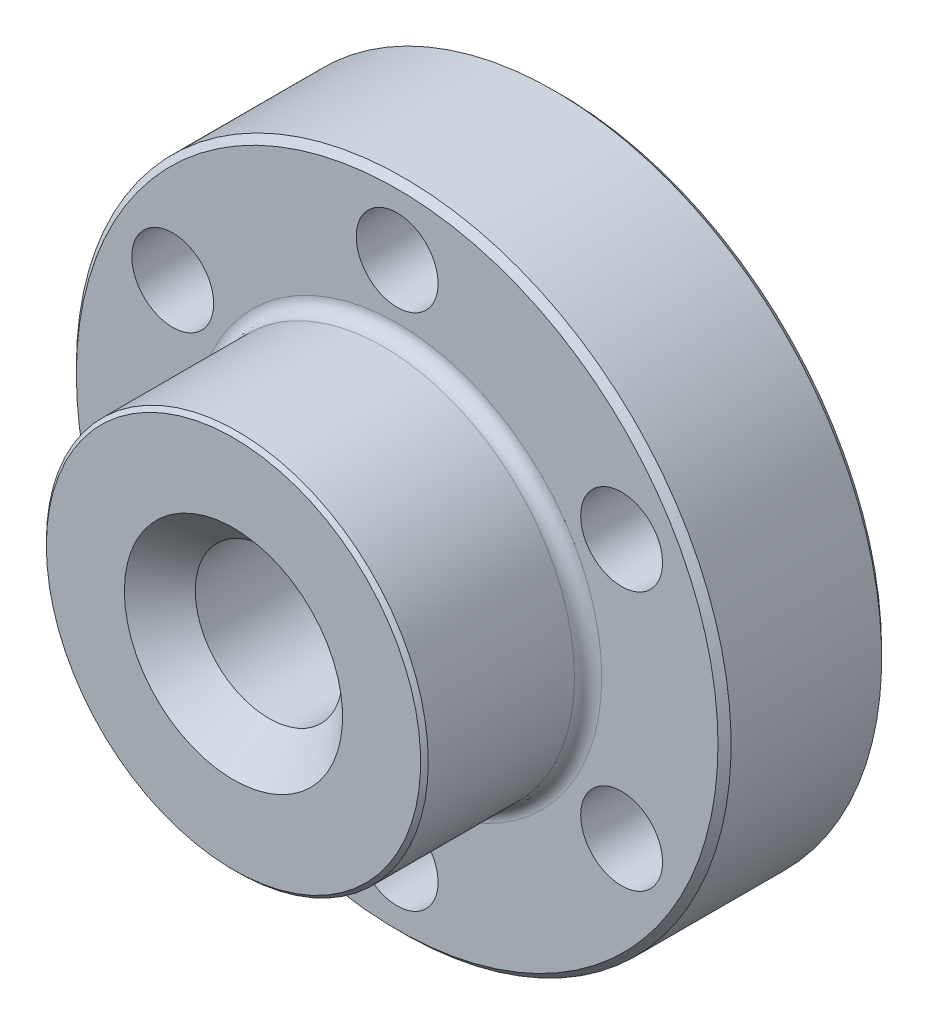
ISO-10303-21;
HEADER;
FILE_DESCRIPTION(('STEP AP214'),'2;1');
FILE_NAME('part.step','',(''),(''),'','','');
FILE_SCHEMA(('AUTOMOTIVE_DESIGN { 1 0 10303 214 1 1 1 1 }'));
ENDSEC;
DATA;
#1=APPLICATION_CONTEXT('core data for automotive mechanical design processes');
#2=APPLICATION_PROTOCOL_DEFINITION('international standard','automotive_design',2000,#1);
#3=PRODUCT_CONTEXT('',#1,'mechanical');
#4=PRODUCT('Part','Part','',(#3));
#5=PRODUCT_RELATED_PRODUCT_CATEGORY('part','',(#4));
#6=PRODUCT_DEFINITION_FORMATION('','',#4);
#7=PRODUCT_DEFINITION_CONTEXT('part definition',#1,'design');
#8=PRODUCT_DEFINITION('design','',#6,#7);
#9=PRODUCT_DEFINITION_SHAPE('','',#8);
#10=(LENGTH_UNIT() NAMED_UNIT(*) SI_UNIT(.MILLI.,.METRE.));
#11=(NAMED_UNIT(*) PLANE_ANGLE_UNIT() SI_UNIT($,.RADIAN.));
#12=(NAMED_UNIT(*) SI_UNIT($,.STERADIAN.) SOLID_ANGLE_UNIT());
#13=UNCERTAINTY_MEASURE_WITH_UNIT(LENGTH_MEASURE(1.E-05),#10,'distance_accuracy_value','');
#14=(GEOMETRIC_REPRESENTATION_CONTEXT(3) GLOBAL_UNCERTAINTY_ASSIGNED_CONTEXT((#13)) GLOBAL_UNIT_ASSIGNED_CONTEXT((#10,
#11,#12)) REPRESENTATION_CONTEXT('',''));
#15=CARTESIAN_POINT('',(0.,0.,0.));
#16=DIRECTION('',(0.,0.,1.));
#17=DIRECTION('',(1.,0.,0.));
#18=AXIS2_PLACEMENT_3D('',#15,#16,#17);
#19=CARTESIAN_POINT('',(0.,23.52,0.));
#20=DIRECTION('',(0.,0.,1.));
#21=DIRECTION('',(1.,0.,0.));
#22=AXIS2_PLACEMENT_3D('',#19,#20,#21);
#23=PLANE('',#22);
#24=CARTESIAN_POINT('',(16.4544826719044,9.5,0.));
#25=DIRECTION('',(0.,0.,1.));
#26=DIRECTION('',(1.,0.,0.));
#27=AXIS2_PLACEMENT_3D('',#24,#25,#26);
#28=CIRCLE('',#27,3.);
#29=CARTESIAN_POINT('',(19.4544826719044,9.5,0.));
#30=VERTEX_POINT('',#29);
#31=EDGE_CURVE('E58',#30,#30,#28,.T.);
#32=ORIENTED_EDGE('',*,*,#31,.T.);
#33=EDGE_LOOP('',(#32));
#34=FACE_BOUND('',#33,.T.);
#35=CARTESIAN_POINT('',(16.4544826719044,-9.5,0.));
#36=DIRECTION('',(0.,0.,1.));
#37=DIRECTION('',(1.,0.,0.));
#38=AXIS2_PLACEMENT_3D('',#35,#36,#37);
#39=CIRCLE('',#38,3.);
#40=CARTESIAN_POINT('',(19.4544826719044,-9.5,0.));
#41=VERTEX_POINT('',#40);
#42=EDGE_CURVE('E54',#41,#41,#39,.T.);
#43=ORIENTED_EDGE('',*,*,#42,.T.);
#44=EDGE_LOOP('',(#43));
#45=FACE_BOUND('',#44,.T.);
#46=CARTESIAN_POINT('',(0.,-19.,0.));
#47=DIRECTION('',(0.,0.,1.));
#48=DIRECTION('',(1.,0.,0.));
#49=AXIS2_PLACEMENT_3D('',#46,#47,#48);
#50=CIRCLE('',#49,3.);
#51=CARTESIAN_POINT('',(3.,-19.,0.));
#52=VERTEX_POINT('',#51);
#53=EDGE_CURVE('E50',#52,#52,#50,.T.);
#54=ORIENTED_EDGE('',*,*,#53,.T.);
#55=EDGE_LOOP('',(#54));
#56=FACE_BOUND('',#55,.T.);
#57=CARTESIAN_POINT('',(-16.4544826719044,-9.5,0.));
#58=DIRECTION('',(0.,0.,1.));
#59=DIRECTION('',(1.,0.,0.));
#60=AXIS2_PLACEMENT_3D('',#57,#58,#59);
#61=CIRCLE('',#60,3.);
#62=CARTESIAN_POINT('',(-13.4544826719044,-9.5,0.));
#63=VERTEX_POINT('',#62);
#64=EDGE_CURVE('E45',#63,#63,#61,.T.);
#65=ORIENTED_EDGE('',*,*,#64,.T.);
#66=EDGE_LOOP('',(#65));
#67=FACE_BOUND('',#66,.T.);
#68=CARTESIAN_POINT('',(-16.4544826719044,9.5,0.));
#69=DIRECTION('',(0.,0.,1.));
#70=DIRECTION('',(1.,0.,0.));
#71=AXIS2_PLACEMENT_3D('',#68,#69,#70);
#72=CIRCLE('',#71,3.);
#73=CARTESIAN_POINT('',(-13.4544826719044,9.5,0.));
#74=VERTEX_POINT('',#73);
#75=EDGE_CURVE('E40',#74,#74,#72,.T.);
#76=ORIENTED_EDGE('',*,*,#75,.T.);
#77=EDGE_LOOP('',(#76));
#78=FACE_BOUND('',#77,.T.);
#79=CARTESIAN_POINT('',(0.,19.,0.));
#80=DIRECTION('',(0.,0.,1.));
#81=DIRECTION('',(1.,0.,0.));
#82=AXIS2_PLACEMENT_3D('',#79,#80,#81);
#83=CIRCLE('',#82,3.);
#84=CARTESIAN_POINT('',(3.,19.,0.));
#85=VERTEX_POINT('',#84);
#86=EDGE_CURVE('E39',#85,#85,#83,.T.);
#87=ORIENTED_EDGE('',*,*,#86,.T.);
#88=EDGE_LOOP('',(#87));
#89=FACE_BOUND('',#88,.T.);
#90=CARTESIAN_POINT('',(0.,0.,0.));
#91=DIRECTION('',(0.,0.,-1.));
#92=DIRECTION('',(-1.,0.,0.));
#93=AXIS2_PLACEMENT_3D('',#90,#91,#92);
#94=CIRCLE('',#93,23.52);
#95=CARTESIAN_POINT('',(-23.52,0.,0.));
#96=VERTEX_POINT('',#95);
#97=EDGE_CURVE('E8',#96,#96,#94,.T.);
#98=ORIENTED_EDGE('',*,*,#97,.T.);
#99=EDGE_LOOP('',(#98));
#100=FACE_BOUND('',#99,.T.);
#101=CARTESIAN_POINT('',(0.,0.,0.));
#102=DIRECTION('',(0.,0.,-1.));
#103=DIRECTION('',(-1.,0.,0.));
#104=AXIS2_PLACEMENT_3D('',#101,#102,#103);
#105=CIRCLE('',#104,8.);
#106=CARTESIAN_POINT('',(-8.,0.,0.));
#107=VERTEX_POINT('',#106);
#108=EDGE_CURVE('E86',#107,#107,#105,.T.);
#109=ORIENTED_EDGE('',*,*,#108,.F.);
#110=EDGE_LOOP('',(#109));
#111=FACE_BOUND('',#110,.T.);
#112=ADVANCED_FACE('F12',(#34,#45,#56,#67,#78,#89,#100,#111),#23,.F.);
#113=CARTESIAN_POINT('',(0.,0.,24.));
#114=DIRECTION('',(0.,0.,-1.));
#115=DIRECTION('',(-1.,0.,0.));
#116=AXIS2_PLACEMENT_3D('',#113,#114,#115);
#117=PLANE('',#116);
#118=CARTESIAN_POINT('',(0.,0.,24.));
#119=DIRECTION('',(0.,0.,-1.));
#120=DIRECTION('',(-1.,0.,0.));
#121=AXIS2_PLACEMENT_3D('',#118,#119,#120);
#122=CIRCLE('',#121,13.72);
#123=CARTESIAN_POINT('',(-13.72,0.,24.));
#124=VERTEX_POINT('',#123);
#125=EDGE_CURVE('E21',#124,#124,#122,.T.);
#126=ORIENTED_EDGE('',*,*,#125,.F.);
#127=EDGE_LOOP('',(#126));
#128=FACE_BOUND('',#127,.T.);
#129=CARTESIAN_POINT('',(0.,0.,24.));
#130=DIRECTION('',(0.,0.,-1.));
#131=DIRECTION('',(-1.,0.,0.));
#132=AXIS2_PLACEMENT_3D('',#129,#130,#131);
#133=CIRCLE('',#132,8.);
#134=CARTESIAN_POINT('',(-8.,0.,24.));
#135=VERTEX_POINT('',#134);
#136=EDGE_CURVE('E97',#135,#135,#133,.T.);
#137=ORIENTED_EDGE('',*,*,#136,.T.);
#138=EDGE_LOOP('',(#137));
#139=FACE_BOUND('',#138,.T.);
#140=ADVANCED_FACE('F135',(#128,#139),#117,.F.);
#141=CARTESIAN_POINT('',(0.,0.,0.48));
#142=DIRECTION('',(0.,0.,1.));
#143=DIRECTION('',(1.,0.,0.));
#144=AXIS2_PLACEMENT_3D('',#141,#142,#143);
#145=CONICAL_SURFACE('',#144,24.,0.785398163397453);
#146=ORIENTED_EDGE('',*,*,#97,.F.);
#147=EDGE_LOOP('',(#146));
#148=FACE_BOUND('',#147,.T.);
#149=CARTESIAN_POINT('',(0.,0.,0.48));
#150=DIRECTION('',(0.,0.,-1.));
#151=DIRECTION('',(-1.,0.,0.));
#152=AXIS2_PLACEMENT_3D('',#149,#150,#151);
#153=CIRCLE('',#152,24.);
#154=CARTESIAN_POINT('',(-24.,0.,0.480000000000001));
#155=VERTEX_POINT('',#154);
#156=EDGE_CURVE('E101',#155,#155,#153,.T.);
#157=ORIENTED_EDGE('',*,*,#156,.T.);
#158=EDGE_LOOP('',(#157));
#159=FACE_BOUND('',#158,.T.);
#160=ADVANCED_FACE('F14',(#148,#159),#145,.T.);
#161=CARTESIAN_POINT('',(0.,0.,24.));
#162=DIRECTION('',(0.,0.,-1.));
#163=DIRECTION('',(-1.,0.,0.));
#164=AXIS2_PLACEMENT_3D('',#161,#162,#163);
#165=CONICAL_SURFACE('',#164,13.72,0.785398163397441);
#166=CARTESIAN_POINT('',(0.,0.,23.72));
#167=DIRECTION('',(0.,0.,-1.));
#168=DIRECTION('',(-1.,0.,0.));
#169=AXIS2_PLACEMENT_3D('',#166,#167,#168);
#170=CIRCLE('',#169,14.);
#171=CARTESIAN_POINT('',(-14.,0.,23.72));
#172=VERTEX_POINT('',#171);
#173=EDGE_CURVE('E31',#172,#172,#170,.T.);
#174=ORIENTED_EDGE('',*,*,#173,.F.);
#175=EDGE_LOOP('',(#174));
#176=FACE_BOUND('',#175,.T.);
#177=ORIENTED_EDGE('',*,*,#125,.T.);
#178=EDGE_LOOP('',(#177));
#179=FACE_BOUND('',#178,.T.);
#180=ADVANCED_FACE('F129',(#176,#179),#165,.T.);
#181=CARTESIAN_POINT('',(0.,0.,0.));
#182=DIRECTION('',(0.,0.,-1.));
#183=DIRECTION('',(-1.,0.,0.));
#184=AXIS2_PLACEMENT_3D('',#181,#182,#183);
#185=CYLINDRICAL_SURFACE('',#184,14.);
#186=CARTESIAN_POINT('',(0.,0.,13.));
#187=DIRECTION('',(0.,0.,-1.));
#188=DIRECTION('',(-1.,0.,0.));
#189=AXIS2_PLACEMENT_3D('',#186,#187,#188);
#190=CIRCLE('',#189,14.);
#191=CARTESIAN_POINT('',(-14.,0.,13.));
#192=VERTEX_POINT('',#191);
#193=EDGE_CURVE('E117',#192,#192,#190,.T.);
#194=ORIENTED_EDGE('',*,*,#193,.F.);
#195=EDGE_LOOP('',(#194));
#196=FACE_BOUND('',#195,.T.);
#197=ORIENTED_EDGE('',*,*,#173,.T.);
#198=EDGE_LOOP('',(#197));
#199=FACE_BOUND('',#198,.T.);
#200=ADVANCED_FACE('F127',(#196,#199),#185,.T.);
#201=CARTESIAN_POINT('',(0.,0.,13.));
#202=DIRECTION('',(0.,0.,-1.));
#203=DIRECTION('',(-1.,0.,0.));
#204=AXIS2_PLACEMENT_3D('',#201,#202,#203);
#205=TOROIDAL_SURFACE('',#204,15.,1.);
#206=ORIENTED_EDGE('',*,*,#193,.T.);
#207=EDGE_LOOP('',(#206));
#208=FACE_BOUND('',#207,.T.);
#209=CARTESIAN_POINT('',(0.,0.,12.));
#210=DIRECTION('',(0.,0.,-1.));
#211=DIRECTION('',(-1.,0.,0.));
#212=AXIS2_PLACEMENT_3D('',#209,#210,#211);
#213=CIRCLE('',#212,15.);
#214=CARTESIAN_POINT('',(-15.,0.,12.));
#215=VERTEX_POINT('',#214);
#216=EDGE_CURVE('E113',#215,#215,#213,.T.);
#217=ORIENTED_EDGE('',*,*,#216,.F.);
#218=EDGE_LOOP('',(#217));
#219=FACE_BOUND('',#218,.T.);
#220=ADVANCED_FACE('F165',(#208,#219),#205,.F.);
#221=CARTESIAN_POINT('',(0.,15.,12.));
#222=DIRECTION('',(0.,0.,-1.));
#223=DIRECTION('',(-1.,0.,0.));
#224=AXIS2_PLACEMENT_3D('',#221,#222,#223);
#225=PLANE('',#224);
#226=CARTESIAN_POINT('',(16.4544826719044,9.5,12.));
#227=DIRECTION('',(0.,0.,-1.));
#228=DIRECTION('',(-1.,0.,0.));
#229=AXIS2_PLACEMENT_3D('',#226,#227,#228);
#230=CIRCLE('',#229,3.);
#231=CARTESIAN_POINT('',(13.4544826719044,9.5,12.));
#232=VERTEX_POINT('',#231);
#233=EDGE_CURVE('E16',#232,#232,#230,.T.);
#234=ORIENTED_EDGE('',*,*,#233,.T.);
#235=EDGE_LOOP('',(#234));
#236=FACE_BOUND('',#235,.T.);
#237=CARTESIAN_POINT('',(16.4544826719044,-9.5,12.));
#238=DIRECTION('',(0.,0.,-1.));
#239=DIRECTION('',(-1.,0.,0.));
#240=AXIS2_PLACEMENT_3D('',#237,#238,#239);
#241=CIRCLE('',#240,3.);
#242=CARTESIAN_POINT('',(13.4544826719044,-9.5,12.));
#243=VERTEX_POINT('',#242);
#244=EDGE_CURVE('E55',#243,#243,#241,.T.);
#245=ORIENTED_EDGE('',*,*,#244,.T.);
#246=EDGE_LOOP('',(#245));
#247=FACE_BOUND('',#246,.T.);
#248=CARTESIAN_POINT('',(0.,-19.,12.));
#249=DIRECTION('',(0.,0.,-1.));
#250=DIRECTION('',(-1.,0.,0.));
#251=AXIS2_PLACEMENT_3D('',#248,#249,#250);
#252=CIRCLE('',#251,3.);
#253=CARTESIAN_POINT('',(-3.,-19.,12.));
#254=VERTEX_POINT('',#253);
#255=EDGE_CURVE('E51',#254,#254,#252,.T.);
#256=ORIENTED_EDGE('',*,*,#255,.T.);
#257=EDGE_LOOP('',(#256));
#258=FACE_BOUND('',#257,.T.);
#259=CARTESIAN_POINT('',(-16.4544826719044,-9.5,12.));
#260=DIRECTION('',(0.,0.,-1.));
#261=DIRECTION('',(-1.,0.,0.));
#262=AXIS2_PLACEMENT_3D('',#259,#260,#261);
#263=CIRCLE('',#262,3.);
#264=CARTESIAN_POINT('',(-19.4544826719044,-9.5,12.));
#265=VERTEX_POINT('',#264);
#266=EDGE_CURVE('E46',#265,#265,#263,.T.);
#267=ORIENTED_EDGE('',*,*,#266,.T.);
#268=EDGE_LOOP('',(#267));
#269=FACE_BOUND('',#268,.T.);
#270=CARTESIAN_POINT('',(-16.4544826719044,9.5,12.));
#271=DIRECTION('',(0.,0.,-1.));
#272=DIRECTION('',(-1.,0.,0.));
#273=AXIS2_PLACEMENT_3D('',#270,#271,#272);
#274=CIRCLE('',#273,3.);
#275=CARTESIAN_POINT('',(-19.4544826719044,9.5,12.));
#276=VERTEX_POINT('',#275);
#277=EDGE_CURVE('E41',#276,#276,#274,.T.);
#278=ORIENTED_EDGE('',*,*,#277,.T.);
#279=EDGE_LOOP('',(#278));
#280=FACE_BOUND('',#279,.T.);
#281=CARTESIAN_POINT('',(0.,19.,12.));
#282=DIRECTION('',(0.,0.,-1.));
#283=DIRECTION('',(-1.,0.,0.));
#284=AXIS2_PLACEMENT_3D('',#281,#282,#283);
#285=CIRCLE('',#284,3.);
#286=CARTESIAN_POINT('',(-3.,19.,12.));
#287=VERTEX_POINT('',#286);
#288=EDGE_CURVE('E35',#287,#287,#285,.T.);
#289=ORIENTED_EDGE('',*,*,#288,.T.);
#290=EDGE_LOOP('',(#289));
#291=FACE_BOUND('',#290,.T.);
#292=CARTESIAN_POINT('',(0.,0.,12.));
#293=DIRECTION('',(0.,0.,-1.));
#294=DIRECTION('',(-1.,0.,0.));
#295=AXIS2_PLACEMENT_3D('',#292,#293,#294);
#296=CIRCLE('',#295,23.52);
#297=CARTESIAN_POINT('',(-23.52,0.,12.));
#298=VERTEX_POINT('',#297);
#299=EDGE_CURVE('E109',#298,#298,#296,.T.);
#300=ORIENTED_EDGE('',*,*,#299,.F.);
#301=EDGE_LOOP('',(#300));
#302=FACE_BOUND('',#301,.T.);
#303=ORIENTED_EDGE('',*,*,#216,.T.);
#304=EDGE_LOOP('',(#303));
#305=FACE_BOUND('',#304,.T.);
#306=ADVANCED_FACE('F169',(#236,#247,#258,#269,#280,#291,#302,#305),#225,.F.);
#307=CARTESIAN_POINT('',(0.,0.,12.));
#308=DIRECTION('',(0.,0.,-1.));
#309=DIRECTION('',(-1.,0.,0.));
#310=AXIS2_PLACEMENT_3D('',#307,#308,#309);
#311=CONICAL_SURFACE('',#310,23.52,0.785398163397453);
#312=CARTESIAN_POINT('',(0.,0.,11.52));
#313=DIRECTION('',(0.,0.,-1.));
#314=DIRECTION('',(-1.,0.,0.));
#315=AXIS2_PLACEMENT_3D('',#312,#313,#314);
#316=CIRCLE('',#315,24.);
#317=CARTESIAN_POINT('',(-24.,0.,11.52));
#318=VERTEX_POINT('',#317);
#319=EDGE_CURVE('E105',#318,#318,#316,.T.);
#320=ORIENTED_EDGE('',*,*,#319,.F.);
#321=EDGE_LOOP('',(#320));
#322=FACE_BOUND('',#321,.T.);
#323=ORIENTED_EDGE('',*,*,#299,.T.);
#324=EDGE_LOOP('',(#323));
#325=FACE_BOUND('',#324,.T.);
#326=ADVANCED_FACE('F155',(#322,#325),#311,.T.);
#327=CARTESIAN_POINT('',(0.,0.,0.));
#328=DIRECTION('',(0.,0.,-1.));
#329=DIRECTION('',(-1.,0.,0.));
#330=AXIS2_PLACEMENT_3D('',#327,#328,#329);
#331=CYLINDRICAL_SURFACE('',#330,24.);
#332=ORIENTED_EDGE('',*,*,#156,.F.);
#333=EDGE_LOOP('',(#332));
#334=FACE_BOUND('',#333,.T.);
#335=ORIENTED_EDGE('',*,*,#319,.T.);
#336=EDGE_LOOP('',(#335));
#337=FACE_BOUND('',#336,.T.);
#338=ADVANCED_FACE('F144',(#334,#337),#331,.T.);
#339=CARTESIAN_POINT('',(0.,0.,24.));
#340=DIRECTION('',(0.,0.,1.));
#341=DIRECTION('',(1.,0.,0.));
#342=AXIS2_PLACEMENT_3D('',#339,#340,#341);
#343=CONICAL_SURFACE('',#342,8.,0.785398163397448);
#344=CARTESIAN_POINT('',(0.,0.,21.4));
#345=DIRECTION('',(0.,0.,-1.));
#346=DIRECTION('',(-1.,0.,0.));
#347=AXIS2_PLACEMENT_3D('',#344,#345,#346);
#348=CIRCLE('',#347,5.4);
#349=CARTESIAN_POINT('',(-5.4,0.,21.4));
#350=VERTEX_POINT('',#349);
#351=EDGE_CURVE('E93',#350,#350,#348,.T.);
#352=ORIENTED_EDGE('',*,*,#351,.T.);
#353=EDGE_LOOP('',(#352));
#354=FACE_BOUND('',#353,.T.);
#355=ORIENTED_EDGE('',*,*,#136,.F.);
#356=EDGE_LOOP('',(#355));
#357=FACE_BOUND('',#356,.T.);
#358=ADVANCED_FACE('F141',(#354,#357),#343,.F.);
#359=CARTESIAN_POINT('',(0.,0.,-1.));
#360=DIRECTION('',(0.,0.,-1.));
#361=DIRECTION('',(-1.,0.,0.));
#362=AXIS2_PLACEMENT_3D('',#359,#360,#361);
#363=CYLINDRICAL_SURFACE('',#362,5.4);
#364=CARTESIAN_POINT('',(0.,0.,2.6));
#365=DIRECTION('',(0.,0.,-1.));
#366=DIRECTION('',(-1.,0.,0.));
#367=AXIS2_PLACEMENT_3D('',#364,#365,#366);
#368=CIRCLE('',#367,5.4);
#369=CARTESIAN_POINT('',(-5.4,0.,2.6));
#370=VERTEX_POINT('',#369);
#371=EDGE_CURVE('E89',#370,#370,#368,.T.);
#372=ORIENTED_EDGE('',*,*,#371,.T.);
#373=EDGE_LOOP('',(#372));
#374=FACE_BOUND('',#373,.T.);
#375=ORIENTED_EDGE('',*,*,#351,.F.);
#376=EDGE_LOOP('',(#375));
#377=FACE_BOUND('',#376,.T.);
#378=ADVANCED_FACE('F143',(#374,#377),#363,.F.);
#379=CARTESIAN_POINT('',(0.,0.,2.6));
#380=DIRECTION('',(0.,0.,-1.));
#381=DIRECTION('',(-1.,0.,0.));
#382=AXIS2_PLACEMENT_3D('',#379,#380,#381);
#383=CONICAL_SURFACE('',#382,5.4,0.785398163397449);
#384=ORIENTED_EDGE('',*,*,#108,.T.);
#385=EDGE_LOOP('',(#384));
#386=FACE_BOUND('',#385,.T.);
#387=ORIENTED_EDGE('',*,*,#371,.F.);
#388=EDGE_LOOP('',(#387));
#389=FACE_BOUND('',#388,.T.);
#390=ADVANCED_FACE('F152',(#386,#389),#383,.F.);
#391=CARTESIAN_POINT('',(0.,19.,-1.));
#392=DIRECTION('',(0.,0.,1.));
#393=DIRECTION('',(0.,-1.,0.));
#394=AXIS2_PLACEMENT_3D('',#391,#392,#393);
#395=CYLINDRICAL_SURFACE('',#394,3.);
#396=ORIENTED_EDGE('',*,*,#288,.F.);
#397=EDGE_LOOP('',(#396));
#398=FACE_BOUND('',#397,.T.);
#399=ORIENTED_EDGE('',*,*,#86,.F.);
#400=EDGE_LOOP('',(#399));
#401=FACE_BOUND('',#400,.T.);
#402=ADVANCED_FACE('F218',(#398,#401),#395,.F.);
#403=CARTESIAN_POINT('',(-16.4544826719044,9.5,-1.));
#404=DIRECTION('',(0.,0.,1.));
#405=DIRECTION('',(0.866025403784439,-0.5,0.));
#406=AXIS2_PLACEMENT_3D('',#403,#404,#405);
#407=CYLINDRICAL_SURFACE('',#406,3.);
#408=ORIENTED_EDGE('',*,*,#277,.F.);
#409=EDGE_LOOP('',(#408));
#410=FACE_BOUND('',#409,.T.);
#411=ORIENTED_EDGE('',*,*,#75,.F.);
#412=EDGE_LOOP('',(#411));
#413=FACE_BOUND('',#412,.T.);
#414=ADVANCED_FACE('F228',(#410,#413),#407,.F.);
#415=CARTESIAN_POINT('',(-16.4544826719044,-9.5,-1.));
#416=DIRECTION('',(0.,0.,1.));
#417=DIRECTION('',(0.866025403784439,0.5,0.));
#418=AXIS2_PLACEMENT_3D('',#415,#416,#417);
#419=CYLINDRICAL_SURFACE('',#418,3.);
#420=ORIENTED_EDGE('',*,*,#266,.F.);
#421=EDGE_LOOP('',(#420));
#422=FACE_BOUND('',#421,.T.);
#423=ORIENTED_EDGE('',*,*,#64,.F.);
#424=EDGE_LOOP('',(#423));
#425=FACE_BOUND('',#424,.T.);
#426=ADVANCED_FACE('F238',(#422,#425),#419,.F.);
#427=CARTESIAN_POINT('',(0.,-19.,-1.));
#428=DIRECTION('',(0.,0.,1.));
#429=DIRECTION('',(0.,1.,0.));
#430=AXIS2_PLACEMENT_3D('',#427,#428,#429);
#431=CYLINDRICAL_SURFACE('',#430,3.);
#432=ORIENTED_EDGE('',*,*,#255,.F.);
#433=EDGE_LOOP('',(#432));
#434=FACE_BOUND('',#433,.T.);
#435=ORIENTED_EDGE('',*,*,#53,.F.);
#436=EDGE_LOOP('',(#435));
#437=FACE_BOUND('',#436,.T.);
#438=ADVANCED_FACE('F248',(#434,#437),#431,.F.);
#439=CARTESIAN_POINT('',(16.4544826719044,-9.5,-1.));
#440=DIRECTION('',(0.,0.,1.));
#441=DIRECTION('',(-0.866025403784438,0.5,0.));
#442=AXIS2_PLACEMENT_3D('',#439,#440,#441);
#443=CYLINDRICAL_SURFACE('',#442,3.);
#444=ORIENTED_EDGE('',*,*,#244,.F.);
#445=EDGE_LOOP('',(#444));
#446=FACE_BOUND('',#445,.T.);
#447=ORIENTED_EDGE('',*,*,#42,.F.);
#448=EDGE_LOOP('',(#447));
#449=FACE_BOUND('',#448,.T.);
#450=ADVANCED_FACE('F258',(#446,#449),#443,.F.);
#451=CARTESIAN_POINT('',(16.4544826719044,9.5,-1.));
#452=DIRECTION('',(0.,0.,1.));
#453=DIRECTION('',(-0.866025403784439,-0.5,0.));
#454=AXIS2_PLACEMENT_3D('',#451,#452,#453);
#455=CYLINDRICAL_SURFACE('',#454,3.);
#456=ORIENTED_EDGE('',*,*,#233,.F.);
#457=EDGE_LOOP('',(#456));
#458=FACE_BOUND('',#457,.T.);
#459=ORIENTED_EDGE('',*,*,#31,.F.);
#460=EDGE_LOOP('',(#459));
#461=FACE_BOUND('',#460,.T.);
#462=ADVANCED_FACE('F268',(#458,#461),#455,.F.);
#463=CLOSED_SHELL('',(#112,#140,#160,#180,#200,#220,#306,#326,#338,#358,#378,#390,#402,#414,
#426,#438,#450,#462));
#464=MANIFOLD_SOLID_BREP('B1',#463);
#465=ADVANCED_BREP_SHAPE_REPRESENTATION('',(#18,#464),#14);
#466=SHAPE_DEFINITION_REPRESENTATION(#9,#465);
ENDSEC;
END-ISO-10303-21;
